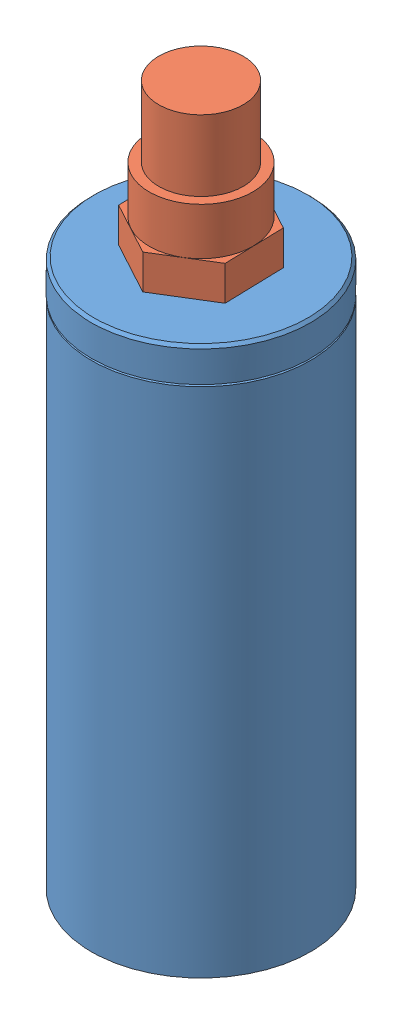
SolidWorks assembly insite it1000.SLDASM, configuration Default (file format 7000). Lengths in mm.
Overall size (40.23 128.58 40.23).
2 component instances, 2 part files, 2 mates.
Components (placement in the parent):
- insite 1t1000 camera-1: insite 1t1000 camera.SLDPRT [Default] at (40.0056 17.0302 99.9996) size (40.23 100.58 40.23)
- subconn conn-1: subconn conn.SLDPRT [Default] at (40.0056 117.6142 99.9996) x (0.99963 0 -0.027185) z (0.027185 0 0.99963) size (19.05 47 22)
Mates (geometry in assembly coordinates):
- Concentric1: concentric anti-aligned: cylinder of insite 1t1000 camera-1 through (40.0056 117.6142 99.9996) axis (0 -1 0) radius 20.1168; cylinder of subconn conn-1 through (40.0056 98.6142 99.9996) axis (0 1 0) radius 5.5563
- Coincident1: coincident anti-aligned: plane of insite 1t1000 camera-1 through (40.0056 117.6142 99.9996) normal (0 1 0); plane of subconn conn-1 through (39.7066 117.6142 89.0051) normal (0 -1 0)
